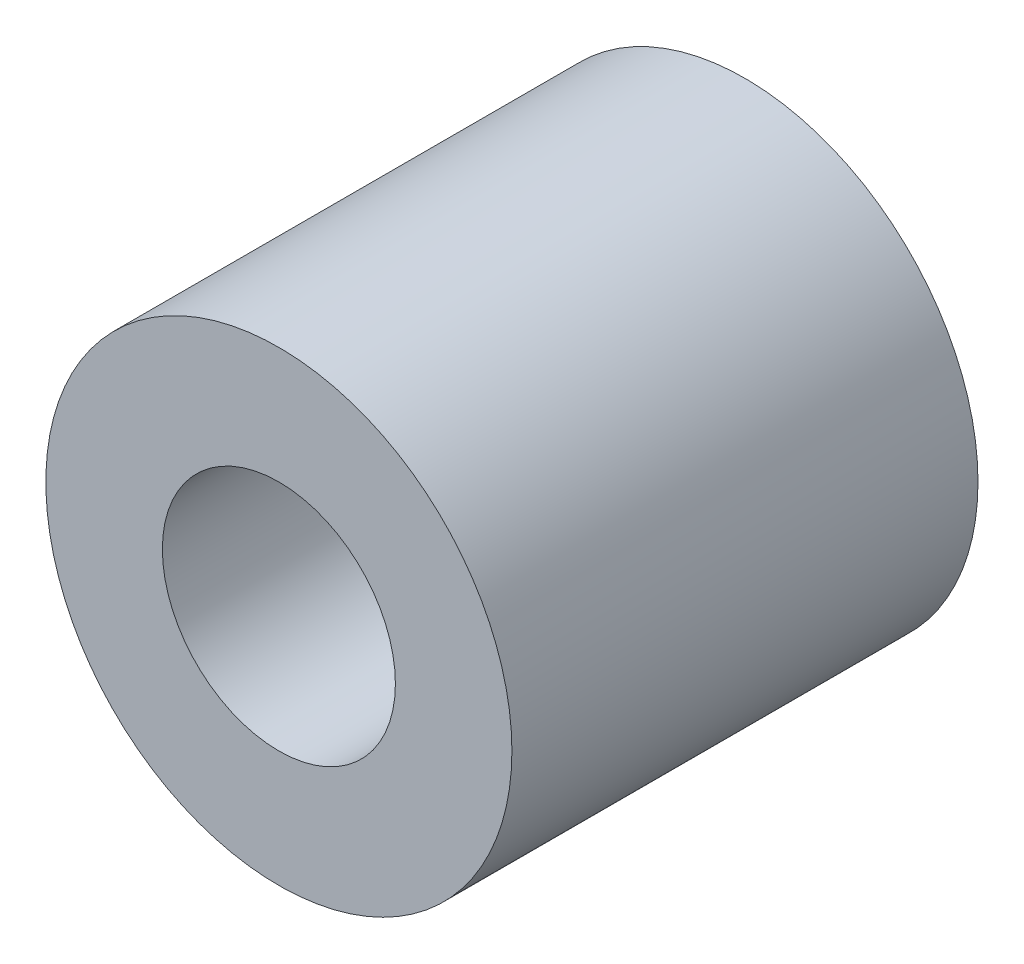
from build123d import *

# Parameters (mm, degrees)
SKETCH1_R           = 3.175
SKETCH1_R_2         = 1.5875
BOSS_EXTRUDE1_DEPTH = 3.175


with BuildPart() as part:
    # Sketch1 → Boss-Extrude1 (new, symmetric)
    with BuildSketch(Plane.XY):
        Circle(SKETCH1_R)
        Circle(SKETCH1_R_2, mode=Mode.SUBTRACT)
    extrude(amount=BOSS_EXTRUDE1_DEPTH, both=True)


solid = part.part
